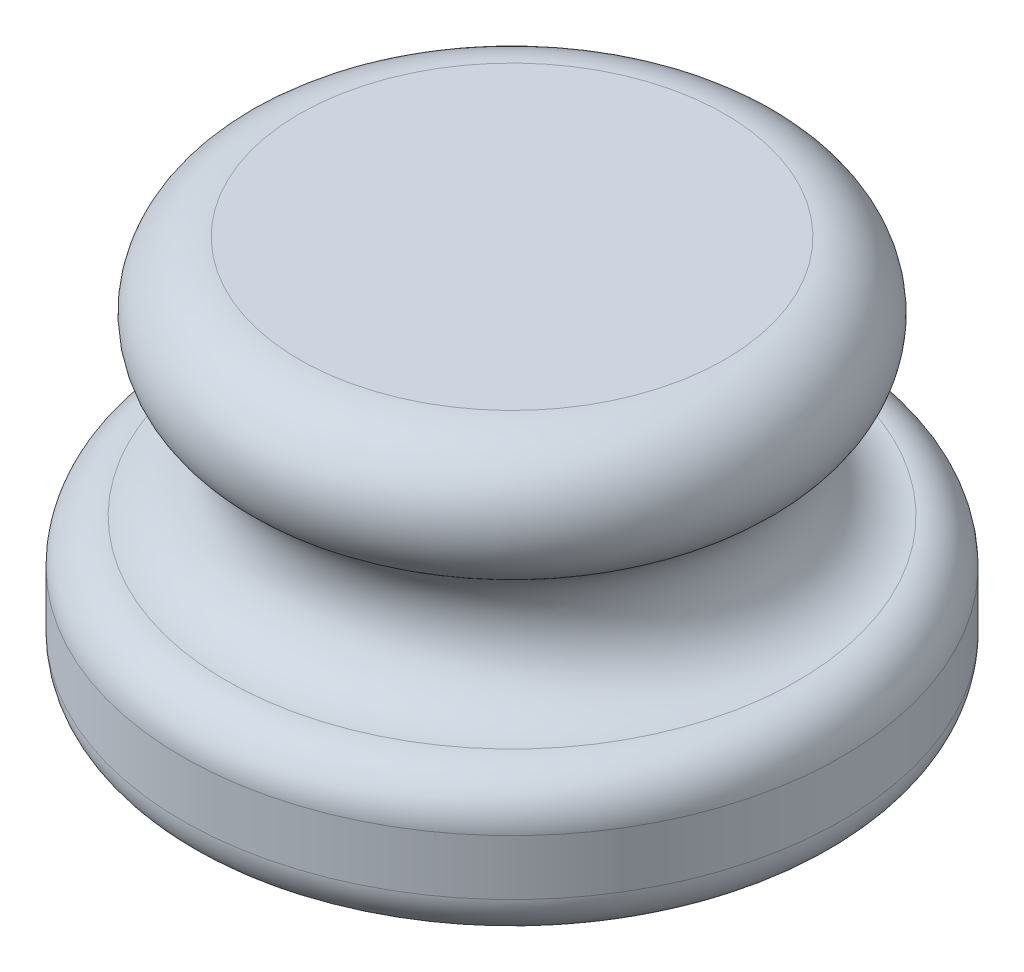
from build123d import *


with BuildPart() as part:
    # Sketch1 → Revolve1 (revolve)
    with BuildSketch(Plane.XY):
        with BuildLine():
            Line((0, 0), (-13, 0))
            ThreePointArc((-13, 0), (-14.414213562, 0.585786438), (-15, 2))
            Line((-15, 2), (-15, 4.52))
            ThreePointArc((-15, 4.52), (-14.414213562, 5.934213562), (-13, 6.52))
            ThreePointArc((-13, 6.52), (-10.127718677, 8.653974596), (-11.341687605, 12.02))
            ThreePointArc((-11.341687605, 12.02), (-12.555656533, 15.386025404), (-9.68337521, 17.52))
            Line((-9.68337521, 17.52), (0, 17.52))
            Line((0, 17.52), (0, 0))
        make_face()
    revolve(axis=Axis((0, 17.52, 0), (0, -1, 0)))


solid = part.part
